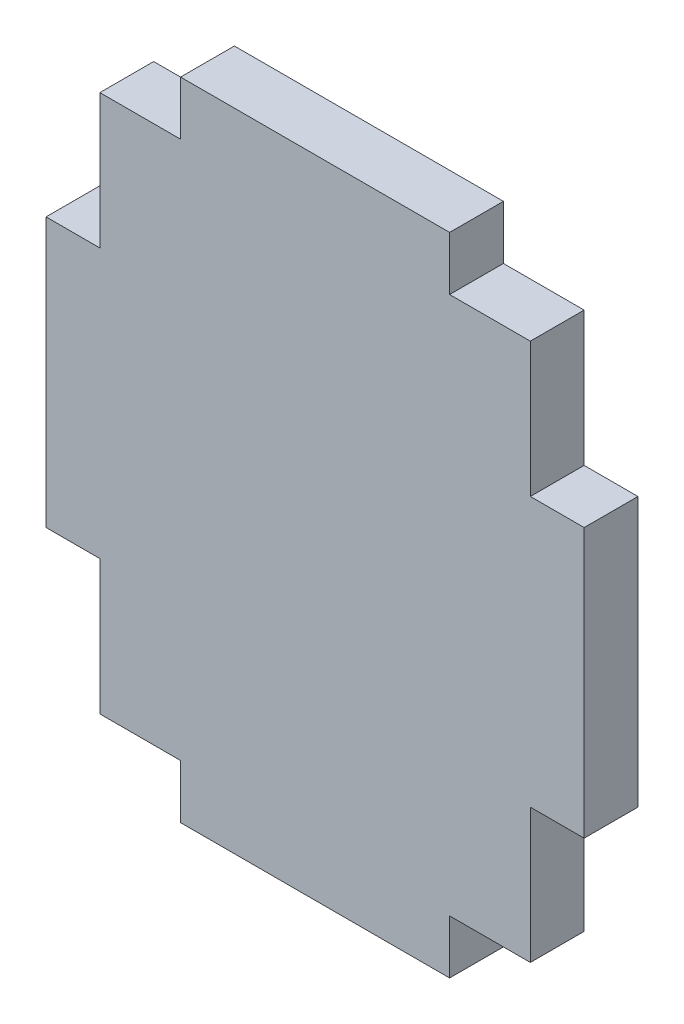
from build123d import *

# Parameters (mm, degrees)
SALIENTE_EXTRUIR1_DEPTH = 3


with BuildPart() as part:
    # Croquis1 → Saliente-Extruir1 (new body)
    with BuildSketch(Plane.XY):
        Polygon((3, 25.5), (0, 25.5), (0, 10.5), (3, 10.5), (3, 3), (7.5, 3), (7.5, 0), (22.5, 0), (22.5, 3), (27, 3), (27, 10.5), (30, 10.5), (30, 25.5), (27, 25.5), (27, 33), (22.5, 33), (22.5, 36), (7.5, 36), (7.5, 33), (3, 33), align=None)
    extrude(amount=SALIENTE_EXTRUIR1_DEPTH)


solid = part.part
